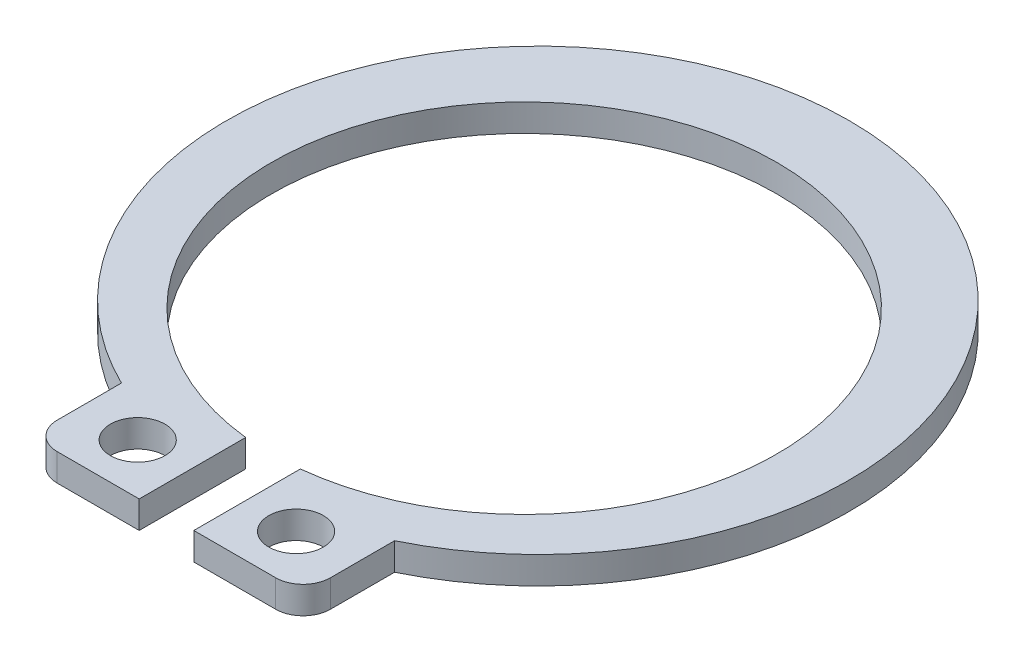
from build123d import *

# Parameters (mm, degrees)
SKETCH_2_R      = 1
EXTRUDE_1_DEPTH = 1


with BuildPart() as part:
    # Sketch 2 → Extrude 1 (new body)
    with BuildSketch(Plane(origin=(0, 0, 0), x_dir=(1, 0, 0), z_dir=(0, 1, 0))):
        with BuildLine():
            Line((1, -13.095787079), (4, -13.095787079))
            ThreePointArc((4, -13.095787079), (4.707106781, -12.80289386), (5, -12.095787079))
            Line((5, -12.095787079), (5, -9.74499878))
            ThreePointArc((5, -9.74499878), (0, 11.9), (-5, -9.74499878))
            Line((-5, -9.74499878), (-5, -12.095787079))
            ThreePointArc((-5, -12.095787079), (-4.707106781, -12.80289386), (-4, -13.095787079))
            Line((-4, -13.095787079), (-1, -13.095787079))
            Line((-1, -13.095787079), (-1, -9.195787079))
            ThreePointArc((-1, -9.195787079), (0, 9.25), (1, -9.195787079))
            Line((1, -9.195787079), (1, -13.095787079))
        make_face()
        with Locations(Location((-2.9, -11.25, 0), (0, 0, 270))):
            Circle(SKETCH_2_R, mode=Mode.SUBTRACT)
        with Locations(Location((2.9, -11.25, 0), (0, 0, 90))):
            Circle(SKETCH_2_R, mode=Mode.SUBTRACT)
    extrude(amount=EXTRUDE_1_DEPTH)


solid = part.part
